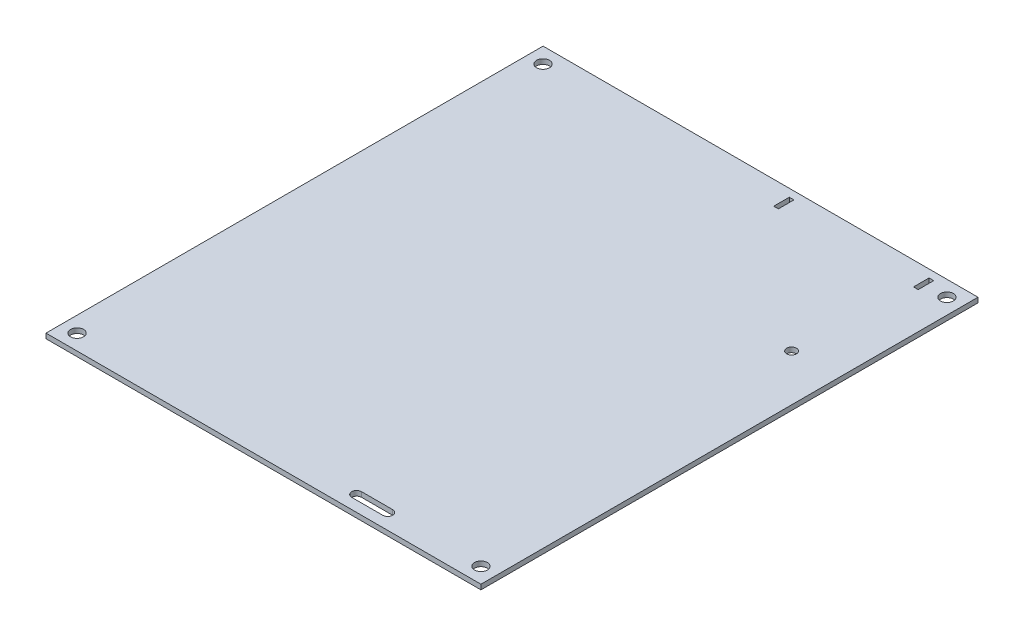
ISO-10303-21;
HEADER;
FILE_DESCRIPTION(('STEP AP214'),'2;1');
FILE_NAME('part.step','',(''),(''),'','','');
FILE_SCHEMA(('AUTOMOTIVE_DESIGN { 1 0 10303 214 1 1 1 1 }'));
ENDSEC;
DATA;
#1=APPLICATION_CONTEXT('core data for automotive mechanical design processes');
#2=APPLICATION_PROTOCOL_DEFINITION('international standard','automotive_design',2000,#1);
#3=PRODUCT_CONTEXT('',#1,'mechanical');
#4=PRODUCT('Part','Part','',(#3));
#5=PRODUCT_RELATED_PRODUCT_CATEGORY('part','',(#4));
#6=PRODUCT_DEFINITION_FORMATION('','',#4);
#7=PRODUCT_DEFINITION_CONTEXT('part definition',#1,'design');
#8=PRODUCT_DEFINITION('design','',#6,#7);
#9=PRODUCT_DEFINITION_SHAPE('','',#8);
#10=(LENGTH_UNIT() NAMED_UNIT(*) SI_UNIT(.MILLI.,.METRE.));
#11=(NAMED_UNIT(*) PLANE_ANGLE_UNIT() SI_UNIT($,.RADIAN.));
#12=(NAMED_UNIT(*) SI_UNIT($,.STERADIAN.) SOLID_ANGLE_UNIT());
#13=UNCERTAINTY_MEASURE_WITH_UNIT(LENGTH_MEASURE(1.E-05),#10,'distance_accuracy_value','');
#14=(GEOMETRIC_REPRESENTATION_CONTEXT(3) GLOBAL_UNCERTAINTY_ASSIGNED_CONTEXT((#13)) GLOBAL_UNIT_ASSIGNED_CONTEXT((#10,
#11,#12)) REPRESENTATION_CONTEXT('',''));
#15=CARTESIAN_POINT('',(0.,0.,0.));
#16=DIRECTION('',(0.,0.,1.));
#17=DIRECTION('',(1.,0.,0.));
#18=AXIS2_PLACEMENT_3D('',#15,#16,#17);
#19=CARTESIAN_POINT('',(0.,3.175,0.));
#20=DIRECTION('',(0.,-1.,0.));
#21=DIRECTION('',(0.,0.,-1.));
#22=AXIS2_PLACEMENT_3D('',#19,#20,#21);
#23=PLANE('',#22);
#24=DIRECTION('',(0.,0.,1.));
#25=VECTOR('',#24,1.);
#26=CARTESIAN_POINT('',(163.5014,3.175,-315.));
#27=LINE('',#26,#25);
#28=CARTESIAN_POINT('',(163.5014,3.175,-315.));
#29=VERTEX_POINT('',#28);
#30=CARTESIAN_POINT('',(163.5014,3.175,-305.));
#31=VERTEX_POINT('',#30);
#32=EDGE_CURVE('E185',#29,#31,#27,.T.);
#33=ORIENTED_EDGE('',*,*,#32,.F.);
#34=DIRECTION('',(-1.,0.,0.));
#35=VECTOR('',#34,1.);
#36=CARTESIAN_POINT('',(163.5014,3.175,-315.));
#37=LINE('',#36,#35);
#38=CARTESIAN_POINT('',(166.4986,3.175,-315.));
#39=VERTEX_POINT('',#38);
#40=EDGE_CURVE('E193',#39,#29,#37,.T.);
#41=ORIENTED_EDGE('',*,*,#40,.F.);
#42=DIRECTION('',(0.,0.,-1.));
#43=VECTOR('',#42,1.);
#44=CARTESIAN_POINT('',(166.4986,3.175,-315.));
#45=LINE('',#44,#43);
#46=CARTESIAN_POINT('',(166.4986,3.175,-305.));
#47=VERTEX_POINT('',#46);
#48=EDGE_CURVE('E190',#47,#39,#45,.T.);
#49=ORIENTED_EDGE('',*,*,#48,.F.);
#50=DIRECTION('',(1.,0.,0.));
#51=VECTOR('',#50,1.);
#52=CARTESIAN_POINT('',(163.5014,3.175,-305.));
#53=LINE('',#52,#51);
#54=EDGE_CURVE('E187',#31,#47,#53,.T.);
#55=ORIENTED_EDGE('',*,*,#54,.F.);
#56=EDGE_LOOP('',(#33,#41,#49,#55));
#57=FACE_BOUND('',#56,.T.);
#58=CARTESIAN_POINT('',(250.,3.175,-230.));
#59=DIRECTION('',(0.,1.,0.));
#60=DIRECTION('',(0.,0.,1.));
#61=AXIS2_PLACEMENT_3D('',#58,#59,#60);
#62=CIRCLE('',#61,3.17499999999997);
#63=CARTESIAN_POINT('',(250.,3.175,-226.825));
#64=VERTEX_POINT('',#63);
#65=EDGE_CURVE('E247',#64,#64,#62,.T.);
#66=ORIENTED_EDGE('',*,*,#65,.F.);
#67=EDGE_LOOP('',(#66));
#68=FACE_BOUND('',#67,.T.);
#69=DIRECTION('',(0.,0.,1.));
#70=VECTOR('',#69,1.);
#71=CARTESIAN_POINT('',(0.,3.175,0.));
#72=LINE('',#71,#70);
#73=CARTESIAN_POINT('',(0.,3.175,-320.));
#74=VERTEX_POINT('',#73);
#75=CARTESIAN_POINT('',(0.,3.175,0.));
#76=VERTEX_POINT('',#75);
#77=EDGE_CURVE('E253',#74,#76,#72,.T.);
#78=ORIENTED_EDGE('',*,*,#77,.T.);
#79=DIRECTION('',(1.,0.,0.));
#80=VECTOR('',#79,1.);
#81=CARTESIAN_POINT('',(0.,3.175,0.));
#82=LINE('',#81,#80);
#83=CARTESIAN_POINT('',(280.,3.175,0.));
#84=VERTEX_POINT('',#83);
#85=EDGE_CURVE('E256',#76,#84,#82,.T.);
#86=ORIENTED_EDGE('',*,*,#85,.T.);
#87=DIRECTION('',(0.,0.,-1.));
#88=VECTOR('',#87,1.);
#89=CARTESIAN_POINT('',(280.,3.175,0.));
#90=LINE('',#89,#88);
#91=CARTESIAN_POINT('',(280.,3.175,-320.));
#92=VERTEX_POINT('',#91);
#93=EDGE_CURVE('E259',#84,#92,#90,.T.);
#94=ORIENTED_EDGE('',*,*,#93,.T.);
#95=DIRECTION('',(-1.,0.,0.));
#96=VECTOR('',#95,1.);
#97=CARTESIAN_POINT('',(0.,3.175,-320.));
#98=LINE('',#97,#96);
#99=EDGE_CURVE('E261',#92,#74,#98,.T.);
#100=ORIENTED_EDGE('',*,*,#99,.T.);
#101=EDGE_LOOP('',(#78,#86,#94,#100));
#102=FACE_BOUND('',#101,.T.);
#103=CARTESIAN_POINT('',(190.,3.175,-9.99999999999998));
#104=DIRECTION('',(0.,1.,0.));
#105=DIRECTION('',(0.,0.,1.));
#106=AXIS2_PLACEMENT_3D('',#103,#104,#105);
#107=CIRCLE('',#106,3.175);
#108=CARTESIAN_POINT('',(190.,3.175,-13.175));
#109=VERTEX_POINT('',#108);
#110=CARTESIAN_POINT('',(190.,3.175,-6.82499999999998));
#111=VERTEX_POINT('',#110);
#112=EDGE_CURVE('E216',#109,#111,#107,.T.);
#113=ORIENTED_EDGE('',*,*,#112,.F.);
#114=DIRECTION('',(-1.,0.,0.));
#115=VECTOR('',#114,1.);
#116=CARTESIAN_POINT('',(190.,3.175,-13.175));
#117=LINE('',#116,#115);
#118=CARTESIAN_POINT('',(210.,3.175,-13.175));
#119=VERTEX_POINT('',#118);
#120=EDGE_CURVE('E224',#119,#109,#117,.T.);
#121=ORIENTED_EDGE('',*,*,#120,.F.);
#122=CARTESIAN_POINT('',(210.,3.175,-9.99999999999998));
#123=DIRECTION('',(0.,1.,0.));
#124=DIRECTION('',(0.,0.,1.));
#125=AXIS2_PLACEMENT_3D('',#122,#123,#124);
#126=CIRCLE('',#125,3.175);
#127=CARTESIAN_POINT('',(210.,3.175,-6.82499999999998));
#128=VERTEX_POINT('',#127);
#129=EDGE_CURVE('E221',#128,#119,#126,.T.);
#130=ORIENTED_EDGE('',*,*,#129,.F.);
#131=DIRECTION('',(1.,0.,0.));
#132=VECTOR('',#131,1.);
#133=CARTESIAN_POINT('',(190.,3.175,-6.82499999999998));
#134=LINE('',#133,#132);
#135=EDGE_CURVE('E218',#111,#128,#134,.T.);
#136=ORIENTED_EDGE('',*,*,#135,.F.);
#137=EDGE_LOOP('',(#113,#121,#130,#136));
#138=FACE_BOUND('',#137,.T.);
#139=DIRECTION('',(0.,0.,1.));
#140=VECTOR('',#139,1.);
#141=CARTESIAN_POINT('',(253.5014,3.175,-315.));
#142=LINE('',#141,#140);
#143=CARTESIAN_POINT('',(253.5014,3.175,-315.));
#144=VERTEX_POINT('',#143);
#145=CARTESIAN_POINT('',(253.5014,3.175,-305.));
#146=VERTEX_POINT('',#145);
#147=EDGE_CURVE('E146',#144,#146,#142,.T.);
#148=ORIENTED_EDGE('',*,*,#147,.F.);
#149=DIRECTION('',(-1.,0.,0.));
#150=VECTOR('',#149,1.);
#151=CARTESIAN_POINT('',(253.5014,3.175,-315.));
#152=LINE('',#151,#150);
#153=CARTESIAN_POINT('',(256.4986,3.175,-315.));
#154=VERTEX_POINT('',#153);
#155=EDGE_CURVE('E169',#154,#144,#152,.T.);
#156=ORIENTED_EDGE('',*,*,#155,.F.);
#157=DIRECTION('',(0.,0.,-1.));
#158=VECTOR('',#157,1.);
#159=CARTESIAN_POINT('',(256.4986,3.175,-315.));
#160=LINE('',#159,#158);
#161=CARTESIAN_POINT('',(256.4986,3.175,-305.));
#162=VERTEX_POINT('',#161);
#163=EDGE_CURVE('E167',#162,#154,#160,.T.);
#164=ORIENTED_EDGE('',*,*,#163,.F.);
#165=DIRECTION('',(1.,0.,0.));
#166=VECTOR('',#165,1.);
#167=CARTESIAN_POINT('',(253.5014,3.175,-305.));
#168=LINE('',#167,#166);
#169=EDGE_CURVE('E154',#146,#162,#168,.T.);
#170=ORIENTED_EDGE('',*,*,#169,.F.);
#171=EDGE_LOOP('',(#148,#156,#164,#170));
#172=FACE_BOUND('',#171,.T.);
#173=CARTESIAN_POINT('',(10.,3.175,-310.));
#174=DIRECTION('',(0.,1.,0.));
#175=DIRECTION('',(0.,0.,1.));
#176=AXIS2_PLACEMENT_3D('',#173,#174,#175);
#177=CIRCLE('',#176,4.175);
#178=CARTESIAN_POINT('',(10.,3.175,-305.825));
#179=VERTEX_POINT('',#178);
#180=EDGE_CURVE('E175',#179,#179,#177,.T.);
#181=ORIENTED_EDGE('',*,*,#180,.F.);
#182=EDGE_LOOP('',(#181));
#183=FACE_BOUND('',#182,.T.);
#184=CARTESIAN_POINT('',(10.,3.175,-10.));
#185=DIRECTION('',(0.,1.,0.));
#186=DIRECTION('',(0.,0.,1.));
#187=AXIS2_PLACEMENT_3D('',#184,#185,#186);
#188=CIRCLE('',#187,4.175);
#189=CARTESIAN_POINT('',(10.,3.175,-5.82500000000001));
#190=VERTEX_POINT('',#189);
#191=EDGE_CURVE('E537',#190,#190,#188,.T.);
#192=ORIENTED_EDGE('',*,*,#191,.F.);
#193=EDGE_LOOP('',(#192));
#194=FACE_BOUND('',#193,.T.);
#195=CARTESIAN_POINT('',(270.,3.175,-10.));
#196=DIRECTION('',(0.,1.,0.));
#197=DIRECTION('',(0.,0.,1.));
#198=AXIS2_PLACEMENT_3D('',#195,#196,#197);
#199=CIRCLE('',#198,4.17499999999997);
#200=CARTESIAN_POINT('',(270.,3.175,-5.82500000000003));
#201=VERTEX_POINT('',#200);
#202=EDGE_CURVE('E531',#201,#201,#199,.T.);
#203=ORIENTED_EDGE('',*,*,#202,.F.);
#204=EDGE_LOOP('',(#203));
#205=FACE_BOUND('',#204,.T.);
#206=CARTESIAN_POINT('',(270.,3.175,-310.));
#207=DIRECTION('',(0.,1.,0.));
#208=DIRECTION('',(0.,0.,1.));
#209=AXIS2_PLACEMENT_3D('',#206,#207,#208);
#210=CIRCLE('',#209,4.17499999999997);
#211=CARTESIAN_POINT('',(270.,3.175,-305.825));
#212=VERTEX_POINT('',#211);
#213=EDGE_CURVE('E522',#212,#212,#210,.T.);
#214=ORIENTED_EDGE('',*,*,#213,.F.);
#215=EDGE_LOOP('',(#214));
#216=FACE_BOUND('',#215,.T.);
#217=ADVANCED_FACE('F33',(#57,#68,#102,#138,#172,#183,#194,#205,#216),#23,.F.);
#218=CARTESIAN_POINT('',(0.,0.,0.));
#219=DIRECTION('',(0.,-1.,0.));
#220=DIRECTION('',(0.,0.,-1.));
#221=AXIS2_PLACEMENT_3D('',#218,#219,#220);
#222=PLANE('',#221);
#223=CARTESIAN_POINT('',(270.,0.,-10.));
#224=DIRECTION('',(0.,1.,0.));
#225=DIRECTION('',(0.,0.,1.));
#226=AXIS2_PLACEMENT_3D('',#223,#224,#225);
#227=CIRCLE('',#226,4.17499999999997);
#228=CARTESIAN_POINT('',(270.,0.,-5.82500000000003));
#229=VERTEX_POINT('',#228);
#230=EDGE_CURVE('E528',#229,#229,#227,.T.);
#231=ORIENTED_EDGE('',*,*,#230,.T.);
#232=EDGE_LOOP('',(#231));
#233=FACE_BOUND('',#232,.T.);
#234=CARTESIAN_POINT('',(10.,0.,-310.));
#235=DIRECTION('',(0.,1.,0.));
#236=DIRECTION('',(0.,0.,1.));
#237=AXIS2_PLACEMENT_3D('',#234,#235,#236);
#238=CIRCLE('',#237,4.175);
#239=CARTESIAN_POINT('',(10.,0.,-305.825));
#240=VERTEX_POINT('',#239);
#241=EDGE_CURVE('E540',#240,#240,#238,.T.);
#242=ORIENTED_EDGE('',*,*,#241,.T.);
#243=EDGE_LOOP('',(#242));
#244=FACE_BOUND('',#243,.T.);
#245=DIRECTION('',(1.,0.,0.));
#246=VECTOR('',#245,1.);
#247=CARTESIAN_POINT('',(140.,0.,0.));
#248=LINE('',#247,#246);
#249=CARTESIAN_POINT('',(0.,0.,0.));
#250=VERTEX_POINT('',#249);
#251=CARTESIAN_POINT('',(280.,0.,0.));
#252=VERTEX_POINT('',#251);
#253=EDGE_CURVE('E250',#250,#252,#248,.T.);
#254=ORIENTED_EDGE('',*,*,#253,.F.);
#255=DIRECTION('',(0.,0.,1.));
#256=VECTOR('',#255,1.);
#257=CARTESIAN_POINT('',(0.,0.,-160.));
#258=LINE('',#257,#256);
#259=CARTESIAN_POINT('',(0.,0.,-320.));
#260=VERTEX_POINT('',#259);
#261=EDGE_CURVE('E257',#260,#250,#258,.T.);
#262=ORIENTED_EDGE('',*,*,#261,.F.);
#263=DIRECTION('',(-1.,0.,0.));
#264=VECTOR('',#263,1.);
#265=CARTESIAN_POINT('',(0.,0.,-320.));
#266=LINE('',#265,#264);
#267=CARTESIAN_POINT('',(280.,0.,-320.));
#268=VERTEX_POINT('',#267);
#269=EDGE_CURVE('E268',#268,#260,#266,.T.);
#270=ORIENTED_EDGE('',*,*,#269,.F.);
#271=DIRECTION('',(0.,0.,-1.));
#272=VECTOR('',#271,1.);
#273=CARTESIAN_POINT('',(280.,0.,0.));
#274=LINE('',#273,#272);
#275=EDGE_CURVE('E266',#252,#268,#274,.T.);
#276=ORIENTED_EDGE('',*,*,#275,.F.);
#277=EDGE_LOOP('',(#254,#262,#270,#276));
#278=FACE_BOUND('',#277,.T.);
#279=CARTESIAN_POINT('',(250.,0.,-230.));
#280=DIRECTION('',(0.,1.,0.));
#281=DIRECTION('',(0.,0.,1.));
#282=AXIS2_PLACEMENT_3D('',#279,#280,#281);
#283=CIRCLE('',#282,3.17499999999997);
#284=CARTESIAN_POINT('',(250.,0.,-226.825));
#285=VERTEX_POINT('',#284);
#286=EDGE_CURVE('E246',#285,#285,#283,.T.);
#287=ORIENTED_EDGE('',*,*,#286,.T.);
#288=EDGE_LOOP('',(#287));
#289=FACE_BOUND('',#288,.T.);
#290=DIRECTION('',(-1.,0.,0.));
#291=VECTOR('',#290,1.);
#292=CARTESIAN_POINT('',(190.,0.,-13.175));
#293=LINE('',#292,#291);
#294=CARTESIAN_POINT('',(210.,0.,-13.175));
#295=VERTEX_POINT('',#294);
#296=CARTESIAN_POINT('',(190.,0.,-13.175));
#297=VERTEX_POINT('',#296);
#298=EDGE_CURVE('E219',#295,#297,#293,.T.);
#299=ORIENTED_EDGE('',*,*,#298,.T.);
#300=CARTESIAN_POINT('',(190.,0.,-9.99999999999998));
#301=DIRECTION('',(0.,1.,0.));
#302=DIRECTION('',(0.,0.,1.));
#303=AXIS2_PLACEMENT_3D('',#300,#301,#302);
#304=CIRCLE('',#303,3.175);
#305=CARTESIAN_POINT('',(190.,0.,-6.82499999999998));
#306=VERTEX_POINT('',#305);
#307=EDGE_CURVE('E215',#297,#306,#304,.T.);
#308=ORIENTED_EDGE('',*,*,#307,.T.);
#309=DIRECTION('',(1.,0.,0.));
#310=VECTOR('',#309,1.);
#311=CARTESIAN_POINT('',(190.,0.,-6.82499999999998));
#312=LINE('',#311,#310);
#313=CARTESIAN_POINT('',(210.,0.,-6.82499999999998));
#314=VERTEX_POINT('',#313);
#315=EDGE_CURVE('E229',#306,#314,#312,.T.);
#316=ORIENTED_EDGE('',*,*,#315,.T.);
#317=CARTESIAN_POINT('',(210.,0.,-9.99999999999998));
#318=DIRECTION('',(0.,1.,0.));
#319=DIRECTION('',(0.,0.,1.));
#320=AXIS2_PLACEMENT_3D('',#317,#318,#319);
#321=CIRCLE('',#320,3.175);
#322=EDGE_CURVE('E232',#314,#295,#321,.T.);
#323=ORIENTED_EDGE('',*,*,#322,.T.);
#324=EDGE_LOOP('',(#299,#308,#316,#323));
#325=FACE_BOUND('',#324,.T.);
#326=DIRECTION('',(-1.,0.,0.));
#327=VECTOR('',#326,1.);
#328=CARTESIAN_POINT('',(163.5014,0.,-315.));
#329=LINE('',#328,#327);
#330=CARTESIAN_POINT('',(166.4986,0.,-315.));
#331=VERTEX_POINT('',#330);
#332=CARTESIAN_POINT('',(163.5014,0.,-315.));
#333=VERTEX_POINT('',#332);
#334=EDGE_CURVE('E188',#331,#333,#329,.T.);
#335=ORIENTED_EDGE('',*,*,#334,.T.);
#336=DIRECTION('',(0.,0.,1.));
#337=VECTOR('',#336,1.);
#338=CARTESIAN_POINT('',(163.5014,0.,-315.));
#339=LINE('',#338,#337);
#340=CARTESIAN_POINT('',(163.5014,0.,-305.));
#341=VERTEX_POINT('',#340);
#342=EDGE_CURVE('E162',#333,#341,#339,.T.);
#343=ORIENTED_EDGE('',*,*,#342,.T.);
#344=DIRECTION('',(1.,0.,0.));
#345=VECTOR('',#344,1.);
#346=CARTESIAN_POINT('',(163.5014,0.,-305.));
#347=LINE('',#346,#345);
#348=CARTESIAN_POINT('',(166.4986,0.,-305.));
#349=VERTEX_POINT('',#348);
#350=EDGE_CURVE('E198',#341,#349,#347,.T.);
#351=ORIENTED_EDGE('',*,*,#350,.T.);
#352=DIRECTION('',(0.,0.,-1.));
#353=VECTOR('',#352,1.);
#354=CARTESIAN_POINT('',(166.4986,0.,-315.));
#355=LINE('',#354,#353);
#356=EDGE_CURVE('E201',#349,#331,#355,.T.);
#357=ORIENTED_EDGE('',*,*,#356,.T.);
#358=EDGE_LOOP('',(#335,#343,#351,#357));
#359=FACE_BOUND('',#358,.T.);
#360=DIRECTION('',(-1.,0.,0.));
#361=VECTOR('',#360,1.);
#362=CARTESIAN_POINT('',(253.5014,0.,-315.));
#363=LINE('',#362,#361);
#364=CARTESIAN_POINT('',(256.4986,0.,-315.));
#365=VERTEX_POINT('',#364);
#366=CARTESIAN_POINT('',(253.5014,0.,-315.));
#367=VERTEX_POINT('',#366);
#368=EDGE_CURVE('E155',#365,#367,#363,.T.);
#369=ORIENTED_EDGE('',*,*,#368,.T.);
#370=DIRECTION('',(0.,0.,1.));
#371=VECTOR('',#370,1.);
#372=CARTESIAN_POINT('',(253.5014,0.,-315.));
#373=LINE('',#372,#371);
#374=CARTESIAN_POINT('',(253.5014,0.,-305.));
#375=VERTEX_POINT('',#374);
#376=EDGE_CURVE('E56',#367,#375,#373,.T.);
#377=ORIENTED_EDGE('',*,*,#376,.T.);
#378=DIRECTION('',(1.,0.,0.));
#379=VECTOR('',#378,1.);
#380=CARTESIAN_POINT('',(253.5014,0.,-305.));
#381=LINE('',#380,#379);
#382=CARTESIAN_POINT('',(256.4986,0.,-305.));
#383=VERTEX_POINT('',#382);
#384=EDGE_CURVE('E161',#375,#383,#381,.T.);
#385=ORIENTED_EDGE('',*,*,#384,.T.);
#386=DIRECTION('',(0.,0.,-1.));
#387=VECTOR('',#386,1.);
#388=CARTESIAN_POINT('',(256.4986,0.,-315.));
#389=LINE('',#388,#387);
#390=EDGE_CURVE('E177',#383,#365,#389,.T.);
#391=ORIENTED_EDGE('',*,*,#390,.T.);
#392=EDGE_LOOP('',(#369,#377,#385,#391));
#393=FACE_BOUND('',#392,.T.);
#394=CARTESIAN_POINT('',(10.,0.,-10.));
#395=DIRECTION('',(0.,1.,0.));
#396=DIRECTION('',(0.,0.,1.));
#397=AXIS2_PLACEMENT_3D('',#394,#395,#396);
#398=CIRCLE('',#397,4.175);
#399=CARTESIAN_POINT('',(10.,0.,-5.82500000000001));
#400=VERTEX_POINT('',#399);
#401=EDGE_CURVE('E534',#400,#400,#398,.T.);
#402=ORIENTED_EDGE('',*,*,#401,.T.);
#403=EDGE_LOOP('',(#402));
#404=FACE_BOUND('',#403,.T.);
#405=CARTESIAN_POINT('',(270.,0.,-310.));
#406=DIRECTION('',(0.,1.,0.));
#407=DIRECTION('',(0.,0.,1.));
#408=AXIS2_PLACEMENT_3D('',#405,#406,#407);
#409=CIRCLE('',#408,4.17499999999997);
#410=CARTESIAN_POINT('',(270.,0.,-305.825));
#411=VERTEX_POINT('',#410);
#412=EDGE_CURVE('E525',#411,#411,#409,.T.);
#413=ORIENTED_EDGE('',*,*,#412,.T.);
#414=EDGE_LOOP('',(#413));
#415=FACE_BOUND('',#414,.T.);
#416=ADVANCED_FACE('F286',(#233,#244,#278,#289,#325,#359,#393,#404,#415),#222,.T.);
#417=CARTESIAN_POINT('',(140.,3.175,0.));
#418=DIRECTION('',(0.,0.,-1.));
#419=DIRECTION('',(-1.,0.,0.));
#420=AXIS2_PLACEMENT_3D('',#417,#418,#419);
#421=PLANE('',#420);
#422=ORIENTED_EDGE('',*,*,#253,.T.);
#423=DIRECTION('',(0.,-1.,0.));
#424=VECTOR('',#423,1.);
#425=CARTESIAN_POINT('',(280.,3.175,0.));
#426=LINE('',#425,#424);
#427=EDGE_CURVE('E41',#84,#252,#426,.T.);
#428=ORIENTED_EDGE('',*,*,#427,.F.);
#429=ORIENTED_EDGE('',*,*,#85,.F.);
#430=DIRECTION('',(0.,-1.,0.));
#431=VECTOR('',#430,1.);
#432=CARTESIAN_POINT('',(0.,3.175,0.));
#433=LINE('',#432,#431);
#434=EDGE_CURVE('E11',#76,#250,#433,.T.);
#435=ORIENTED_EDGE('',*,*,#434,.T.);
#436=EDGE_LOOP('',(#422,#428,#429,#435));
#437=FACE_BOUND('',#436,.T.);
#438=ADVANCED_FACE('F35',(#437),#421,.F.);
#439=CARTESIAN_POINT('',(280.,3.175,0.));
#440=DIRECTION('',(-1.,0.,0.));
#441=DIRECTION('',(0.,0.,1.));
#442=AXIS2_PLACEMENT_3D('',#439,#440,#441);
#443=PLANE('',#442);
#444=ORIENTED_EDGE('',*,*,#275,.T.);
#445=DIRECTION('',(0.,-1.,0.));
#446=VECTOR('',#445,1.);
#447=CARTESIAN_POINT('',(280.,3.175,-320.));
#448=LINE('',#447,#446);
#449=EDGE_CURVE('E274',#92,#268,#448,.T.);
#450=ORIENTED_EDGE('',*,*,#449,.F.);
#451=ORIENTED_EDGE('',*,*,#93,.F.);
#452=ORIENTED_EDGE('',*,*,#427,.T.);
#453=EDGE_LOOP('',(#444,#450,#451,#452));
#454=FACE_BOUND('',#453,.T.);
#455=ADVANCED_FACE('F281',(#454),#443,.F.);
#456=CARTESIAN_POINT('',(0.,3.175,-320.));
#457=DIRECTION('',(0.,0.,1.));
#458=DIRECTION('',(1.,0.,0.));
#459=AXIS2_PLACEMENT_3D('',#456,#457,#458);
#460=PLANE('',#459);
#461=ORIENTED_EDGE('',*,*,#269,.T.);
#462=DIRECTION('',(0.,-1.,0.));
#463=VECTOR('',#462,1.);
#464=CARTESIAN_POINT('',(0.,3.175,-320.));
#465=LINE('',#464,#463);
#466=EDGE_CURVE('E264',#74,#260,#465,.T.);
#467=ORIENTED_EDGE('',*,*,#466,.F.);
#468=ORIENTED_EDGE('',*,*,#99,.F.);
#469=ORIENTED_EDGE('',*,*,#449,.T.);
#470=EDGE_LOOP('',(#461,#467,#468,#469));
#471=FACE_BOUND('',#470,.T.);
#472=ADVANCED_FACE('F291',(#471),#460,.F.);
#473=CARTESIAN_POINT('',(0.,3.175,-160.));
#474=DIRECTION('',(1.,0.,0.));
#475=DIRECTION('',(0.,0.,-1.));
#476=AXIS2_PLACEMENT_3D('',#473,#474,#475);
#477=PLANE('',#476);
#478=ORIENTED_EDGE('',*,*,#261,.T.);
#479=ORIENTED_EDGE('',*,*,#434,.F.);
#480=ORIENTED_EDGE('',*,*,#77,.F.);
#481=ORIENTED_EDGE('',*,*,#466,.T.);
#482=EDGE_LOOP('',(#478,#479,#480,#481));
#483=FACE_BOUND('',#482,.T.);
#484=ADVANCED_FACE('F294',(#483),#477,.F.);
#485=CARTESIAN_POINT('',(250.,3.175,-230.));
#486=DIRECTION('',(0.,-1.,0.));
#487=DIRECTION('',(0.,0.,-1.));
#488=AXIS2_PLACEMENT_3D('',#485,#486,#487);
#489=CYLINDRICAL_SURFACE('',#488,3.17499999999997);
#490=ORIENTED_EDGE('',*,*,#65,.T.);
#491=EDGE_LOOP('',(#490));
#492=FACE_BOUND('',#491,.T.);
#493=ORIENTED_EDGE('',*,*,#286,.F.);
#494=EDGE_LOOP('',(#493));
#495=FACE_BOUND('',#494,.T.);
#496=ADVANCED_FACE('F313',(#492,#495),#489,.F.);
#497=CARTESIAN_POINT('',(190.,3.175,-9.99999999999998));
#498=DIRECTION('',(0.,-1.,0.));
#499=DIRECTION('',(0.,0.,-1.));
#500=AXIS2_PLACEMENT_3D('',#497,#498,#499);
#501=CYLINDRICAL_SURFACE('',#500,3.175);
#502=ORIENTED_EDGE('',*,*,#307,.F.);
#503=DIRECTION('',(0.,-1.,0.));
#504=VECTOR('',#503,1.);
#505=CARTESIAN_POINT('',(190.,3.175,-13.175));
#506=LINE('',#505,#504);
#507=EDGE_CURVE('E226',#109,#297,#506,.T.);
#508=ORIENTED_EDGE('',*,*,#507,.F.);
#509=ORIENTED_EDGE('',*,*,#112,.T.);
#510=DIRECTION('',(0.,-1.,0.));
#511=VECTOR('',#510,1.);
#512=CARTESIAN_POINT('',(190.,3.175,-6.82499999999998));
#513=LINE('',#512,#511);
#514=EDGE_CURVE('E243',#111,#306,#513,.T.);
#515=ORIENTED_EDGE('',*,*,#514,.T.);
#516=EDGE_LOOP('',(#502,#508,#509,#515));
#517=FACE_BOUND('',#516,.T.);
#518=ADVANCED_FACE('F333',(#517),#501,.F.);
#519=CARTESIAN_POINT('',(190.,3.175,-6.82499999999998));
#520=DIRECTION('',(0.,0.,-1.));
#521=DIRECTION('',(-1.,0.,0.));
#522=AXIS2_PLACEMENT_3D('',#519,#520,#521);
#523=PLANE('',#522);
#524=ORIENTED_EDGE('',*,*,#315,.F.);
#525=ORIENTED_EDGE('',*,*,#514,.F.);
#526=ORIENTED_EDGE('',*,*,#135,.T.);
#527=DIRECTION('',(0.,-1.,0.));
#528=VECTOR('',#527,1.);
#529=CARTESIAN_POINT('',(210.,3.175,-6.82499999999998));
#530=LINE('',#529,#528);
#531=EDGE_CURVE('E241',#128,#314,#530,.T.);
#532=ORIENTED_EDGE('',*,*,#531,.T.);
#533=EDGE_LOOP('',(#524,#525,#526,#532));
#534=FACE_BOUND('',#533,.T.);
#535=ADVANCED_FACE('F340',(#534),#523,.T.);
#536=CARTESIAN_POINT('',(210.,3.175,-9.99999999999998));
#537=DIRECTION('',(0.,-1.,0.));
#538=DIRECTION('',(0.,0.,-1.));
#539=AXIS2_PLACEMENT_3D('',#536,#537,#538);
#540=CYLINDRICAL_SURFACE('',#539,3.175);
#541=ORIENTED_EDGE('',*,*,#322,.F.);
#542=ORIENTED_EDGE('',*,*,#531,.F.);
#543=ORIENTED_EDGE('',*,*,#129,.T.);
#544=DIRECTION('',(0.,-1.,0.));
#545=VECTOR('',#544,1.);
#546=CARTESIAN_POINT('',(210.,3.175,-13.175));
#547=LINE('',#546,#545);
#548=EDGE_CURVE('E239',#119,#295,#547,.T.);
#549=ORIENTED_EDGE('',*,*,#548,.T.);
#550=EDGE_LOOP('',(#541,#542,#543,#549));
#551=FACE_BOUND('',#550,.T.);
#552=ADVANCED_FACE('F347',(#551),#540,.F.);
#553=CARTESIAN_POINT('',(190.,3.175,-13.175));
#554=DIRECTION('',(0.,0.,1.));
#555=DIRECTION('',(1.,0.,0.));
#556=AXIS2_PLACEMENT_3D('',#553,#554,#555);
#557=PLANE('',#556);
#558=ORIENTED_EDGE('',*,*,#298,.F.);
#559=ORIENTED_EDGE('',*,*,#548,.F.);
#560=ORIENTED_EDGE('',*,*,#120,.T.);
#561=ORIENTED_EDGE('',*,*,#507,.T.);
#562=EDGE_LOOP('',(#558,#559,#560,#561));
#563=FACE_BOUND('',#562,.T.);
#564=ADVANCED_FACE('F355',(#563),#557,.T.);
#565=CARTESIAN_POINT('',(163.5014,3.175,-315.));
#566=DIRECTION('',(1.,0.,0.));
#567=DIRECTION('',(0.,0.,-1.));
#568=AXIS2_PLACEMENT_3D('',#565,#566,#567);
#569=PLANE('',#568);
#570=ORIENTED_EDGE('',*,*,#342,.F.);
#571=DIRECTION('',(0.,-1.,0.));
#572=VECTOR('',#571,1.);
#573=CARTESIAN_POINT('',(163.5014,3.175,-315.));
#574=LINE('',#573,#572);
#575=EDGE_CURVE('E195',#29,#333,#574,.T.);
#576=ORIENTED_EDGE('',*,*,#575,.F.);
#577=ORIENTED_EDGE('',*,*,#32,.T.);
#578=DIRECTION('',(0.,-1.,0.));
#579=VECTOR('',#578,1.);
#580=CARTESIAN_POINT('',(163.5014,3.175,-305.));
#581=LINE('',#580,#579);
#582=EDGE_CURVE('E212',#31,#341,#581,.T.);
#583=ORIENTED_EDGE('',*,*,#582,.T.);
#584=EDGE_LOOP('',(#570,#576,#577,#583));
#585=FACE_BOUND('',#584,.T.);
#586=ADVANCED_FACE('F363',(#585),#569,.T.);
#587=CARTESIAN_POINT('',(163.5014,3.175,-305.));
#588=DIRECTION('',(0.,0.,-1.));
#589=DIRECTION('',(-1.,0.,0.));
#590=AXIS2_PLACEMENT_3D('',#587,#588,#589);
#591=PLANE('',#590);
#592=ORIENTED_EDGE('',*,*,#350,.F.);
#593=ORIENTED_EDGE('',*,*,#582,.F.);
#594=ORIENTED_EDGE('',*,*,#54,.T.);
#595=DIRECTION('',(0.,-1.,0.));
#596=VECTOR('',#595,1.);
#597=CARTESIAN_POINT('',(166.4986,3.175,-305.));
#598=LINE('',#597,#596);
#599=EDGE_CURVE('E210',#47,#349,#598,.T.);
#600=ORIENTED_EDGE('',*,*,#599,.T.);
#601=EDGE_LOOP('',(#592,#593,#594,#600));
#602=FACE_BOUND('',#601,.T.);
#603=ADVANCED_FACE('F371',(#602),#591,.T.);
#604=CARTESIAN_POINT('',(166.4986,3.175,-315.));
#605=DIRECTION('',(-1.,0.,0.));
#606=DIRECTION('',(0.,0.,1.));
#607=AXIS2_PLACEMENT_3D('',#604,#605,#606);
#608=PLANE('',#607);
#609=ORIENTED_EDGE('',*,*,#356,.F.);
#610=ORIENTED_EDGE('',*,*,#599,.F.);
#611=ORIENTED_EDGE('',*,*,#48,.T.);
#612=DIRECTION('',(0.,-1.,0.));
#613=VECTOR('',#612,1.);
#614=CARTESIAN_POINT('',(166.4986,3.175,-315.));
#615=LINE('',#614,#613);
#616=EDGE_CURVE('E208',#39,#331,#615,.T.);
#617=ORIENTED_EDGE('',*,*,#616,.T.);
#618=EDGE_LOOP('',(#609,#610,#611,#617));
#619=FACE_BOUND('',#618,.T.);
#620=ADVANCED_FACE('F379',(#619),#608,.T.);
#621=CARTESIAN_POINT('',(163.5014,3.175,-315.));
#622=DIRECTION('',(0.,0.,1.));
#623=DIRECTION('',(1.,0.,0.));
#624=AXIS2_PLACEMENT_3D('',#621,#622,#623);
#625=PLANE('',#624);
#626=ORIENTED_EDGE('',*,*,#334,.F.);
#627=ORIENTED_EDGE('',*,*,#616,.F.);
#628=ORIENTED_EDGE('',*,*,#40,.T.);
#629=ORIENTED_EDGE('',*,*,#575,.T.);
#630=EDGE_LOOP('',(#626,#627,#628,#629));
#631=FACE_BOUND('',#630,.T.);
#632=ADVANCED_FACE('F387',(#631),#625,.T.);
#633=CARTESIAN_POINT('',(253.5014,3.175,-315.));
#634=DIRECTION('',(1.,0.,0.));
#635=DIRECTION('',(0.,0.,-1.));
#636=AXIS2_PLACEMENT_3D('',#633,#634,#635);
#637=PLANE('',#636);
#638=ORIENTED_EDGE('',*,*,#376,.F.);
#639=DIRECTION('',(0.,-1.,0.));
#640=VECTOR('',#639,1.);
#641=CARTESIAN_POINT('',(253.5014,3.175,-315.));
#642=LINE('',#641,#640);
#643=EDGE_CURVE('E150',#144,#367,#642,.T.);
#644=ORIENTED_EDGE('',*,*,#643,.F.);
#645=ORIENTED_EDGE('',*,*,#147,.T.);
#646=DIRECTION('',(0.,-1.,0.));
#647=VECTOR('',#646,1.);
#648=CARTESIAN_POINT('',(253.5014,3.175,-305.));
#649=LINE('',#648,#647);
#650=EDGE_CURVE('E149',#146,#375,#649,.T.);
#651=ORIENTED_EDGE('',*,*,#650,.T.);
#652=EDGE_LOOP('',(#638,#644,#645,#651));
#653=FACE_BOUND('',#652,.T.);
#654=ADVANCED_FACE('F148',(#653),#637,.T.);
#655=CARTESIAN_POINT('',(253.5014,3.175,-305.));
#656=DIRECTION('',(0.,0.,-1.));
#657=DIRECTION('',(-1.,0.,0.));
#658=AXIS2_PLACEMENT_3D('',#655,#656,#657);
#659=PLANE('',#658);
#660=ORIENTED_EDGE('',*,*,#384,.F.);
#661=ORIENTED_EDGE('',*,*,#650,.F.);
#662=ORIENTED_EDGE('',*,*,#169,.T.);
#663=DIRECTION('',(0.,-1.,0.));
#664=VECTOR('',#663,1.);
#665=CARTESIAN_POINT('',(256.4986,3.175,-305.));
#666=LINE('',#665,#664);
#667=EDGE_CURVE('E163',#162,#383,#666,.T.);
#668=ORIENTED_EDGE('',*,*,#667,.T.);
#669=EDGE_LOOP('',(#660,#661,#662,#668));
#670=FACE_BOUND('',#669,.T.);
#671=ADVANCED_FACE('F158',(#670),#659,.T.);
#672=CARTESIAN_POINT('',(256.4986,3.175,-315.));
#673=DIRECTION('',(-1.,0.,0.));
#674=DIRECTION('',(0.,0.,1.));
#675=AXIS2_PLACEMENT_3D('',#672,#673,#674);
#676=PLANE('',#675);
#677=ORIENTED_EDGE('',*,*,#390,.F.);
#678=ORIENTED_EDGE('',*,*,#667,.F.);
#679=ORIENTED_EDGE('',*,*,#163,.T.);
#680=DIRECTION('',(0.,-1.,0.));
#681=VECTOR('',#680,1.);
#682=CARTESIAN_POINT('',(256.4986,3.175,-315.));
#683=LINE('',#682,#681);
#684=EDGE_CURVE('E48',#154,#365,#683,.T.);
#685=ORIENTED_EDGE('',*,*,#684,.T.);
#686=EDGE_LOOP('',(#677,#678,#679,#685));
#687=FACE_BOUND('',#686,.T.);
#688=ADVANCED_FACE('F408',(#687),#676,.T.);
#689=CARTESIAN_POINT('',(253.5014,3.175,-315.));
#690=DIRECTION('',(0.,0.,1.));
#691=DIRECTION('',(1.,0.,0.));
#692=AXIS2_PLACEMENT_3D('',#689,#690,#691);
#693=PLANE('',#692);
#694=ORIENTED_EDGE('',*,*,#368,.F.);
#695=ORIENTED_EDGE('',*,*,#684,.F.);
#696=ORIENTED_EDGE('',*,*,#155,.T.);
#697=ORIENTED_EDGE('',*,*,#643,.T.);
#698=EDGE_LOOP('',(#694,#695,#696,#697));
#699=FACE_BOUND('',#698,.T.);
#700=ADVANCED_FACE('F415',(#699),#693,.T.);
#701=CARTESIAN_POINT('',(10.,3.175,-310.));
#702=DIRECTION('',(0.,-1.,0.));
#703=DIRECTION('',(0.,0.,-1.));
#704=AXIS2_PLACEMENT_3D('',#701,#702,#703);
#705=CYLINDRICAL_SURFACE('',#704,4.175);
#706=ORIENTED_EDGE('',*,*,#180,.T.);
#707=EDGE_LOOP('',(#706));
#708=FACE_BOUND('',#707,.T.);
#709=ORIENTED_EDGE('',*,*,#241,.F.);
#710=EDGE_LOOP('',(#709));
#711=FACE_BOUND('',#710,.T.);
#712=ADVANCED_FACE('F423',(#708,#711),#705,.F.);
#713=CARTESIAN_POINT('',(10.,3.175,-10.));
#714=DIRECTION('',(0.,-1.,0.));
#715=DIRECTION('',(0.,0.,-1.));
#716=AXIS2_PLACEMENT_3D('',#713,#714,#715);
#717=CYLINDRICAL_SURFACE('',#716,4.175);
#718=ORIENTED_EDGE('',*,*,#191,.T.);
#719=EDGE_LOOP('',(#718));
#720=FACE_BOUND('',#719,.T.);
#721=ORIENTED_EDGE('',*,*,#401,.F.);
#722=EDGE_LOOP('',(#721));
#723=FACE_BOUND('',#722,.T.);
#724=ADVANCED_FACE('F430',(#720,#723),#717,.F.);
#725=CARTESIAN_POINT('',(270.,3.175,-10.));
#726=DIRECTION('',(0.,-1.,0.));
#727=DIRECTION('',(0.,0.,-1.));
#728=AXIS2_PLACEMENT_3D('',#725,#726,#727);
#729=CYLINDRICAL_SURFACE('',#728,4.17499999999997);
#730=ORIENTED_EDGE('',*,*,#202,.T.);
#731=EDGE_LOOP('',(#730));
#732=FACE_BOUND('',#731,.T.);
#733=ORIENTED_EDGE('',*,*,#230,.F.);
#734=EDGE_LOOP('',(#733));
#735=FACE_BOUND('',#734,.T.);
#736=ADVANCED_FACE('F438',(#732,#735),#729,.F.);
#737=CARTESIAN_POINT('',(270.,3.175,-310.));
#738=DIRECTION('',(0.,-1.,0.));
#739=DIRECTION('',(0.,0.,-1.));
#740=AXIS2_PLACEMENT_3D('',#737,#738,#739);
#741=CYLINDRICAL_SURFACE('',#740,4.17499999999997);
#742=ORIENTED_EDGE('',*,*,#213,.T.);
#743=EDGE_LOOP('',(#742));
#744=FACE_BOUND('',#743,.T.);
#745=ORIENTED_EDGE('',*,*,#412,.F.);
#746=EDGE_LOOP('',(#745));
#747=FACE_BOUND('',#746,.T.);
#748=ADVANCED_FACE('F446',(#744,#747),#741,.F.);
#749=CLOSED_SHELL('',(#217,#416,#438,#455,#472,#484,#496,#518,#535,#552,#564,#586,#603,#620,
#632,#654,#671,#688,#700,#712,#724,#736,#748));
#750=MANIFOLD_SOLID_BREP('B2',#749);
#751=ADVANCED_BREP_SHAPE_REPRESENTATION('',(#18,#750),#14);
#752=SHAPE_DEFINITION_REPRESENTATION(#9,#751);
ENDSEC;
END-ISO-10303-21;
